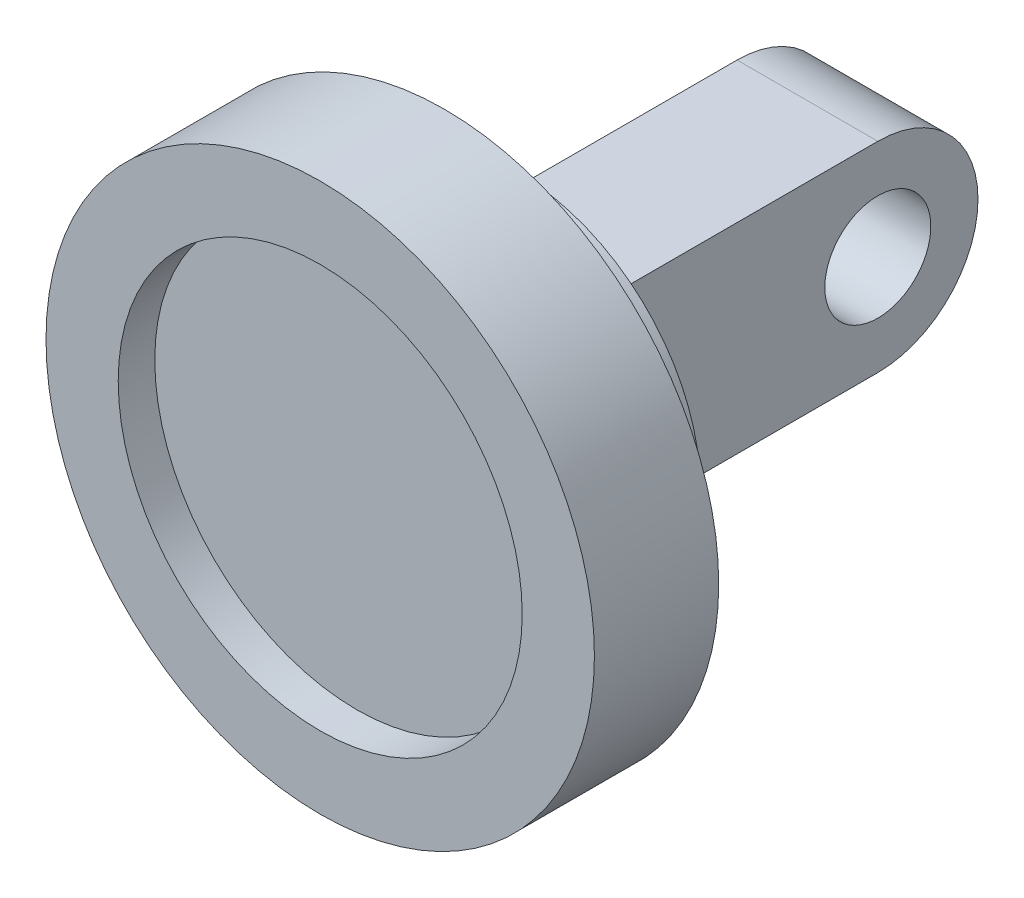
ISO-10303-21;
HEADER;
FILE_DESCRIPTION(('STEP AP214'),'2;1');
FILE_NAME('part.step','',(''),(''),'','','');
FILE_SCHEMA(('AUTOMOTIVE_DESIGN { 1 0 10303 214 1 1 1 1 }'));
ENDSEC;
DATA;
#1=APPLICATION_CONTEXT('core data for automotive mechanical design processes');
#2=APPLICATION_PROTOCOL_DEFINITION('international standard','automotive_design',2000,#1);
#3=PRODUCT_CONTEXT('',#1,'mechanical');
#4=PRODUCT('Part','Part','',(#3));
#5=PRODUCT_RELATED_PRODUCT_CATEGORY('part','',(#4));
#6=PRODUCT_DEFINITION_FORMATION('','',#4);
#7=PRODUCT_DEFINITION_CONTEXT('part definition',#1,'design');
#8=PRODUCT_DEFINITION('design','',#6,#7);
#9=PRODUCT_DEFINITION_SHAPE('','',#8);
#10=(LENGTH_UNIT() NAMED_UNIT(*) SI_UNIT(.MILLI.,.METRE.));
#11=(NAMED_UNIT(*) PLANE_ANGLE_UNIT() SI_UNIT($,.RADIAN.));
#12=(NAMED_UNIT(*) SI_UNIT($,.STERADIAN.) SOLID_ANGLE_UNIT());
#13=UNCERTAINTY_MEASURE_WITH_UNIT(LENGTH_MEASURE(1.E-05),#10,'distance_accuracy_value','');
#14=(GEOMETRIC_REPRESENTATION_CONTEXT(3) GLOBAL_UNCERTAINTY_ASSIGNED_CONTEXT((#13)) GLOBAL_UNIT_ASSIGNED_CONTEXT((#10,
#11,#12)) REPRESENTATION_CONTEXT('',''));
#15=CARTESIAN_POINT('',(0.,0.,0.));
#16=DIRECTION('',(0.,0.,1.));
#17=DIRECTION('',(1.,0.,0.));
#18=AXIS2_PLACEMENT_3D('',#15,#16,#17);
#19=CARTESIAN_POINT('',(-38.5,92.2916572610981,-321.333333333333));
#20=DIRECTION('',(1.,0.,0.));
#21=DIRECTION('',(0.,0.,-1.));
#22=AXIS2_PLACEMENT_3D('',#19,#20,#21);
#23=PLANE('',#22);
#24=CARTESIAN_POINT('',(-38.5,0.,-266.533333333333));
#25=DIRECTION('',(-1.,0.,0.));
#26=DIRECTION('',(0.,0.,1.));
#27=AXIS2_PLACEMENT_3D('',#24,#25,#26);
#28=CIRCLE('',#27,29.);
#29=CARTESIAN_POINT('',(-38.5,0.,-237.533333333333));
#30=VERTEX_POINT('',#29);
#31=EDGE_CURVE('E133',#30,#30,#28,.T.);
#32=ORIENTED_EDGE('',*,*,#31,.F.);
#33=EDGE_LOOP('',(#32));
#34=FACE_BOUND('',#33,.T.);
#35=CARTESIAN_POINT('',(-38.5,0.,-266.533333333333));
#36=DIRECTION('',(1.,0.,0.));
#37=DIRECTION('',(0.,0.,-1.));
#38=AXIS2_PLACEMENT_3D('',#35,#36,#37);
#39=CIRCLE('',#38,54.8);
#40=CARTESIAN_POINT('',(-38.5,54.8,-266.533333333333));
#41=VERTEX_POINT('',#40);
#42=CARTESIAN_POINT('',(-38.5,-54.8,-266.533333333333));
#43=VERTEX_POINT('',#42);
#44=EDGE_CURVE('E90',#41,#43,#39,.F.);
#45=ORIENTED_EDGE('',*,*,#44,.T.);
#46=DIRECTION('',(0.,0.,1.));
#47=VECTOR('',#46,1.);
#48=CARTESIAN_POINT('',(-38.5,-54.8,-321.333333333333));
#49=LINE('',#48,#47);
#50=CARTESIAN_POINT('',(-38.5,-54.8,-108.));
#51=VERTEX_POINT('',#50);
#52=EDGE_CURVE('E125',#43,#51,#49,.T.);
#53=ORIENTED_EDGE('',*,*,#52,.T.);
#54=DIRECTION('',(0.,1.,0.));
#55=VECTOR('',#54,1.);
#56=CARTESIAN_POINT('',(-38.5,92.2916572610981,-108.));
#57=LINE('',#56,#55);
#58=CARTESIAN_POINT('',(-38.5,54.8,-108.));
#59=VERTEX_POINT('',#58);
#60=EDGE_CURVE('E82',#51,#59,#57,.T.);
#61=ORIENTED_EDGE('',*,*,#60,.T.);
#62=DIRECTION('',(0.,0.,-1.));
#63=VECTOR('',#62,1.);
#64=CARTESIAN_POINT('',(-38.5,54.8,-321.333333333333));
#65=LINE('',#64,#63);
#66=EDGE_CURVE('E143',#59,#41,#65,.T.);
#67=ORIENTED_EDGE('',*,*,#66,.T.);
#68=EDGE_LOOP('',(#45,#53,#61,#67));
#69=FACE_BOUND('',#68,.T.);
#70=ADVANCED_FACE('F66',(#34,#69),#23,.F.);
#71=CARTESIAN_POINT('',(38.5,92.2916572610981,-321.333333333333));
#72=DIRECTION('',(-1.,0.,0.));
#73=DIRECTION('',(0.,0.,1.));
#74=AXIS2_PLACEMENT_3D('',#71,#72,#73);
#75=PLANE('',#74);
#76=CARTESIAN_POINT('',(38.5,0.,-266.533333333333));
#77=DIRECTION('',(-1.,0.,0.));
#78=DIRECTION('',(0.,0.,1.));
#79=AXIS2_PLACEMENT_3D('',#76,#77,#78);
#80=CIRCLE('',#79,29.);
#81=CARTESIAN_POINT('',(38.5,0.,-237.533333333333));
#82=VERTEX_POINT('',#81);
#83=EDGE_CURVE('E70',#82,#82,#80,.T.);
#84=ORIENTED_EDGE('',*,*,#83,.T.);
#85=EDGE_LOOP('',(#84));
#86=FACE_BOUND('',#85,.T.);
#87=DIRECTION('',(0.,-1.,0.));
#88=VECTOR('',#87,1.);
#89=CARTESIAN_POINT('',(38.5,92.2916572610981,-108.));
#90=LINE('',#89,#88);
#91=CARTESIAN_POINT('',(38.5,54.8,-108.));
#92=VERTEX_POINT('',#91);
#93=CARTESIAN_POINT('',(38.5,-54.8,-108.));
#94=VERTEX_POINT('',#93);
#95=EDGE_CURVE('E130',#92,#94,#90,.T.);
#96=ORIENTED_EDGE('',*,*,#95,.T.);
#97=DIRECTION('',(0.,0.,1.));
#98=VECTOR('',#97,1.);
#99=CARTESIAN_POINT('',(38.5,-54.8,0.));
#100=LINE('',#99,#98);
#101=CARTESIAN_POINT('',(38.5,-54.8,-266.533333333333));
#102=VERTEX_POINT('',#101);
#103=EDGE_CURVE('E123',#102,#94,#100,.T.);
#104=ORIENTED_EDGE('',*,*,#103,.F.);
#105=CARTESIAN_POINT('',(38.5,0.,-266.533333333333));
#106=DIRECTION('',(1.,0.,0.));
#107=DIRECTION('',(0.,0.,-1.));
#108=AXIS2_PLACEMENT_3D('',#105,#106,#107);
#109=CIRCLE('',#108,54.8);
#110=CARTESIAN_POINT('',(38.5,54.8,-266.533333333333));
#111=VERTEX_POINT('',#110);
#112=EDGE_CURVE('E108',#111,#102,#109,.F.);
#113=ORIENTED_EDGE('',*,*,#112,.F.);
#114=DIRECTION('',(0.,0.,-1.));
#115=VECTOR('',#114,1.);
#116=CARTESIAN_POINT('',(38.5,54.8,0.));
#117=LINE('',#116,#115);
#118=EDGE_CURVE('E117',#92,#111,#117,.T.);
#119=ORIENTED_EDGE('',*,*,#118,.F.);
#120=EDGE_LOOP('',(#96,#104,#113,#119));
#121=FACE_BOUND('',#120,.T.);
#122=ADVANCED_FACE('F128',(#86,#121),#75,.F.);
#123=CARTESIAN_POINT('',(0.,100.,-108.));
#124=DIRECTION('',(0.,0.,1.));
#125=DIRECTION('',(1.,0.,0.));
#126=AXIS2_PLACEMENT_3D('',#123,#124,#125);
#127=PLANE('',#126);
#128=ORIENTED_EDGE('',*,*,#60,.F.);
#129=DIRECTION('',(1.,0.,0.));
#130=VECTOR('',#129,1.);
#131=CARTESIAN_POINT('',(-761.5,-54.8,-108.));
#132=LINE('',#131,#130);
#133=EDGE_CURVE('E126',#51,#94,#132,.T.);
#134=ORIENTED_EDGE('',*,*,#133,.T.);
#135=ORIENTED_EDGE('',*,*,#95,.F.);
#136=DIRECTION('',(1.,0.,0.));
#137=VECTOR('',#136,1.);
#138=CARTESIAN_POINT('',(-761.5,54.8,-108.));
#139=LINE('',#138,#137);
#140=EDGE_CURVE('E139',#59,#92,#139,.T.);
#141=ORIENTED_EDGE('',*,*,#140,.F.);
#142=EDGE_LOOP('',(#128,#134,#135,#141));
#143=FACE_BOUND('',#142,.T.);
#144=CARTESIAN_POINT('',(0.,0.,-108.));
#145=DIRECTION('',(0.,0.,1.));
#146=DIRECTION('',(1.,0.,0.));
#147=AXIS2_PLACEMENT_3D('',#144,#145,#146);
#148=CIRCLE('',#147,100.);
#149=CARTESIAN_POINT('',(100.,0.,-108.));
#150=VERTEX_POINT('',#149);
#151=EDGE_CURVE('E153',#150,#150,#148,.T.);
#152=ORIENTED_EDGE('',*,*,#151,.F.);
#153=EDGE_LOOP('',(#152));
#154=FACE_BOUND('',#153,.T.);
#155=ADVANCED_FACE('F177',(#143,#154),#127,.F.);
#156=CARTESIAN_POINT('',(0.,110.5,0.));
#157=DIRECTION('',(0.,0.,-1.));
#158=DIRECTION('',(-1.,0.,0.));
#159=AXIS2_PLACEMENT_3D('',#156,#157,#158);
#160=PLANE('',#159);
#161=CARTESIAN_POINT('',(0.,0.,0.));
#162=DIRECTION('',(0.,0.,1.));
#163=DIRECTION('',(1.,0.,0.));
#164=AXIS2_PLACEMENT_3D('',#161,#162,#163);
#165=CIRCLE('',#164,110.5);
#166=CARTESIAN_POINT('',(110.5,0.,0.));
#167=VERTEX_POINT('',#166);
#168=EDGE_CURVE('E147',#167,#167,#165,.T.);
#169=ORIENTED_EDGE('',*,*,#168,.F.);
#170=EDGE_LOOP('',(#169));
#171=FACE_BOUND('',#170,.T.);
#172=CARTESIAN_POINT('',(0.,0.,0.));
#173=DIRECTION('',(0.,0.,1.));
#174=DIRECTION('',(1.,0.,0.));
#175=AXIS2_PLACEMENT_3D('',#172,#173,#174);
#176=CIRCLE('',#175,150.);
#177=CARTESIAN_POINT('',(150.,0.,0.));
#178=VERTEX_POINT('',#177);
#179=EDGE_CURVE('E12',#178,#178,#176,.T.);
#180=ORIENTED_EDGE('',*,*,#179,.T.);
#181=EDGE_LOOP('',(#180));
#182=FACE_BOUND('',#181,.T.);
#183=ADVANCED_FACE('F68',(#171,#182),#160,.F.);
#184=CARTESIAN_POINT('',(0.,0.,0.));
#185=DIRECTION('',(0.,0.,1.));
#186=DIRECTION('',(1.,0.,0.));
#187=AXIS2_PLACEMENT_3D('',#184,#185,#186);
#188=CYLINDRICAL_SURFACE('',#187,150.);
#189=ORIENTED_EDGE('',*,*,#179,.F.);
#190=EDGE_LOOP('',(#189));
#191=FACE_BOUND('',#190,.T.);
#192=CARTESIAN_POINT('',(0.,0.,-68.));
#193=DIRECTION('',(0.,0.,1.));
#194=DIRECTION('',(1.,0.,0.));
#195=AXIS2_PLACEMENT_3D('',#192,#193,#194);
#196=CIRCLE('',#195,150.);
#197=CARTESIAN_POINT('',(150.,0.,-68.));
#198=VERTEX_POINT('',#197);
#199=EDGE_CURVE('E75',#198,#198,#196,.T.);
#200=ORIENTED_EDGE('',*,*,#199,.T.);
#201=EDGE_LOOP('',(#200));
#202=FACE_BOUND('',#201,.T.);
#203=ADVANCED_FACE('F162',(#191,#202),#188,.T.);
#204=CARTESIAN_POINT('',(0.,150.,-68.));
#205=DIRECTION('',(0.,0.,1.));
#206=DIRECTION('',(1.,0.,0.));
#207=AXIS2_PLACEMENT_3D('',#204,#205,#206);
#208=PLANE('',#207);
#209=ORIENTED_EDGE('',*,*,#199,.F.);
#210=EDGE_LOOP('',(#209));
#211=FACE_BOUND('',#210,.T.);
#212=CARTESIAN_POINT('',(0.,0.,-68.));
#213=DIRECTION('',(0.,0.,1.));
#214=DIRECTION('',(1.,0.,0.));
#215=AXIS2_PLACEMENT_3D('',#212,#213,#214);
#216=CIRCLE('',#215,100.);
#217=CARTESIAN_POINT('',(100.,0.,-68.));
#218=VERTEX_POINT('',#217);
#219=EDGE_CURVE('E156',#218,#218,#216,.T.);
#220=ORIENTED_EDGE('',*,*,#219,.T.);
#221=EDGE_LOOP('',(#220));
#222=FACE_BOUND('',#221,.T.);
#223=ADVANCED_FACE('F164',(#211,#222),#208,.F.);
#224=CARTESIAN_POINT('',(0.,0.,0.));
#225=DIRECTION('',(0.,0.,1.));
#226=DIRECTION('',(1.,0.,0.));
#227=AXIS2_PLACEMENT_3D('',#224,#225,#226);
#228=CYLINDRICAL_SURFACE('',#227,100.);
#229=ORIENTED_EDGE('',*,*,#219,.F.);
#230=EDGE_LOOP('',(#229));
#231=FACE_BOUND('',#230,.T.);
#232=ORIENTED_EDGE('',*,*,#151,.T.);
#233=EDGE_LOOP('',(#232));
#234=FACE_BOUND('',#233,.T.);
#235=ADVANCED_FACE('F167',(#231,#234),#228,.T.);
#236=CARTESIAN_POINT('',(0.,110.5,-20.));
#237=DIRECTION('',(0.,0.,-1.));
#238=DIRECTION('',(-1.,0.,0.));
#239=AXIS2_PLACEMENT_3D('',#236,#237,#238);
#240=PLANE('',#239);
#241=CARTESIAN_POINT('',(0.,0.,-20.));
#242=DIRECTION('',(0.,0.,1.));
#243=DIRECTION('',(1.,0.,0.));
#244=AXIS2_PLACEMENT_3D('',#241,#242,#243);
#245=CIRCLE('',#244,110.5);
#246=CARTESIAN_POINT('',(110.5,0.,-20.));
#247=VERTEX_POINT('',#246);
#248=EDGE_CURVE('E150',#247,#247,#245,.T.);
#249=ORIENTED_EDGE('',*,*,#248,.T.);
#250=EDGE_LOOP('',(#249));
#251=FACE_BOUND('',#250,.T.);
#252=ADVANCED_FACE('F173',(#251),#240,.F.);
#253=CARTESIAN_POINT('',(0.,0.,0.));
#254=DIRECTION('',(0.,0.,1.));
#255=DIRECTION('',(1.,0.,0.));
#256=AXIS2_PLACEMENT_3D('',#253,#254,#255);
#257=CYLINDRICAL_SURFACE('',#256,110.5);
#258=ORIENTED_EDGE('',*,*,#248,.F.);
#259=EDGE_LOOP('',(#258));
#260=FACE_BOUND('',#259,.T.);
#261=ORIENTED_EDGE('',*,*,#168,.T.);
#262=EDGE_LOOP('',(#261));
#263=FACE_BOUND('',#262,.T.);
#264=ADVANCED_FACE('F197',(#260,#263),#257,.F.);
#265=CARTESIAN_POINT('',(-761.5,54.8,0.));
#266=DIRECTION('',(0.,-1.,0.));
#267=DIRECTION('',(0.,0.,-1.));
#268=AXIS2_PLACEMENT_3D('',#265,#266,#267);
#269=PLANE('',#268);
#270=ORIENTED_EDGE('',*,*,#140,.T.);
#271=ORIENTED_EDGE('',*,*,#118,.T.);
#272=DIRECTION('',(1.,0.,0.));
#273=VECTOR('',#272,1.);
#274=CARTESIAN_POINT('',(-761.5,54.8,-266.533333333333));
#275=LINE('',#274,#273);
#276=EDGE_CURVE('E112',#41,#111,#275,.T.);
#277=ORIENTED_EDGE('',*,*,#276,.F.);
#278=ORIENTED_EDGE('',*,*,#66,.F.);
#279=EDGE_LOOP('',(#270,#271,#277,#278));
#280=FACE_BOUND('',#279,.T.);
#281=ADVANCED_FACE('F199',(#280),#269,.F.);
#282=CARTESIAN_POINT('',(-761.5,0.,-266.533333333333));
#283=DIRECTION('',(1.,0.,0.));
#284=DIRECTION('',(0.,0.,-1.));
#285=AXIS2_PLACEMENT_3D('',#282,#283,#284);
#286=CYLINDRICAL_SURFACE('',#285,54.8);
#287=ORIENTED_EDGE('',*,*,#276,.T.);
#288=ORIENTED_EDGE('',*,*,#112,.T.);
#289=DIRECTION('',(1.,0.,0.));
#290=VECTOR('',#289,1.);
#291=CARTESIAN_POINT('',(-761.5,-54.8,-266.533333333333));
#292=LINE('',#291,#290);
#293=EDGE_CURVE('E111',#43,#102,#292,.T.);
#294=ORIENTED_EDGE('',*,*,#293,.F.);
#295=ORIENTED_EDGE('',*,*,#44,.F.);
#296=EDGE_LOOP('',(#287,#288,#294,#295));
#297=FACE_BOUND('',#296,.T.);
#298=ADVANCED_FACE('F110',(#297),#286,.T.);
#299=CARTESIAN_POINT('',(-761.5,-54.8,0.));
#300=DIRECTION('',(0.,1.,0.));
#301=DIRECTION('',(0.,0.,1.));
#302=AXIS2_PLACEMENT_3D('',#299,#300,#301);
#303=PLANE('',#302);
#304=ORIENTED_EDGE('',*,*,#293,.T.);
#305=ORIENTED_EDGE('',*,*,#103,.T.);
#306=ORIENTED_EDGE('',*,*,#133,.F.);
#307=ORIENTED_EDGE('',*,*,#52,.F.);
#308=EDGE_LOOP('',(#304,#305,#306,#307));
#309=FACE_BOUND('',#308,.T.);
#310=ADVANCED_FACE('F122',(#309),#303,.F.);
#311=CARTESIAN_POINT('',(150.,0.,-266.533333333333));
#312=DIRECTION('',(-1.,0.,0.));
#313=DIRECTION('',(0.,0.,1.));
#314=AXIS2_PLACEMENT_3D('',#311,#312,#313);
#315=CYLINDRICAL_SURFACE('',#314,29.);
#316=ORIENTED_EDGE('',*,*,#31,.T.);
#317=EDGE_LOOP('',(#316));
#318=FACE_BOUND('',#317,.T.);
#319=ORIENTED_EDGE('',*,*,#83,.F.);
#320=EDGE_LOOP('',(#319));
#321=FACE_BOUND('',#320,.T.);
#322=ADVANCED_FACE('F253',(#318,#321),#315,.F.);
#323=CLOSED_SHELL('',(#70,#122,#155,#183,#203,#223,#235,#252,#264,#281,#298,#310,#322));
#324=MANIFOLD_SOLID_BREP('B2',#323);
#325=ADVANCED_BREP_SHAPE_REPRESENTATION('',(#18,#324),#14);
#326=SHAPE_DEFINITION_REPRESENTATION(#9,#325);
ENDSEC;
END-ISO-10303-21;
